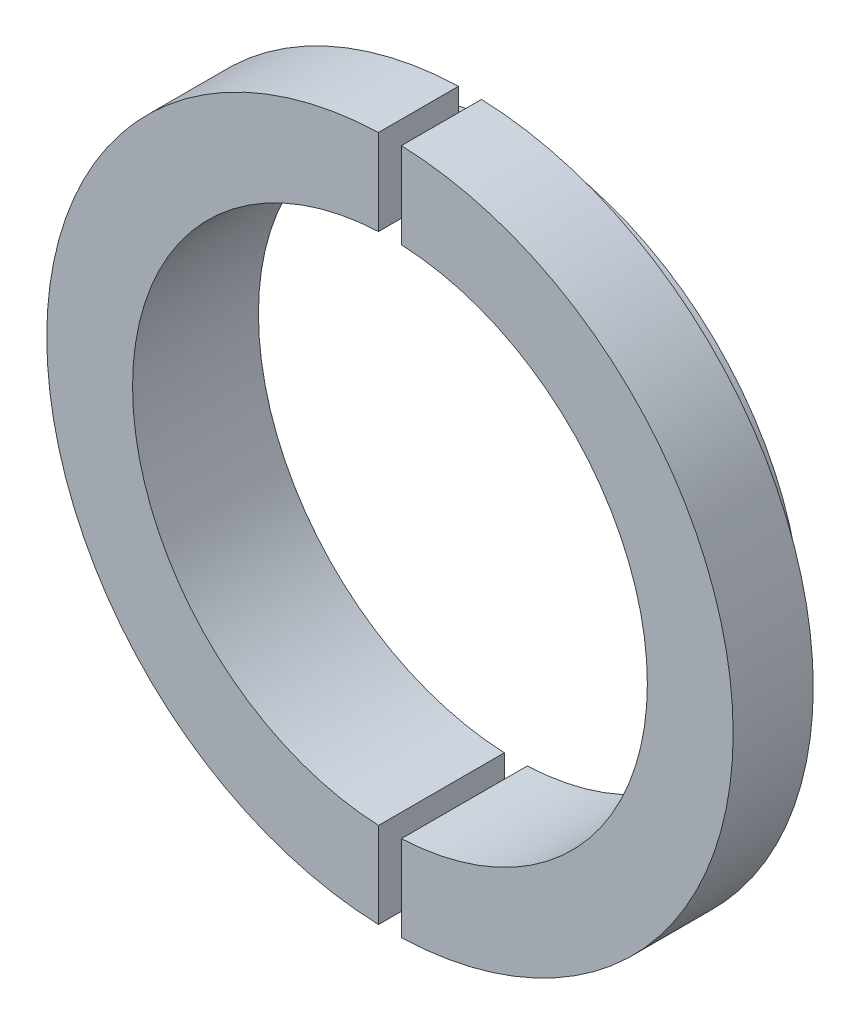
ISO-10303-21;
HEADER;
FILE_DESCRIPTION(('STEP AP214'),'2;1');
FILE_NAME('part.step','',(''),(''),'','','');
FILE_SCHEMA(('AUTOMOTIVE_DESIGN { 1 0 10303 214 1 1 1 1 }'));
ENDSEC;
DATA;
#1=APPLICATION_CONTEXT('core data for automotive mechanical design processes');
#2=APPLICATION_PROTOCOL_DEFINITION('international standard','automotive_design',2000,#1);
#3=PRODUCT_CONTEXT('',#1,'mechanical');
#4=PRODUCT('Part','Part','',(#3));
#5=PRODUCT_RELATED_PRODUCT_CATEGORY('part','',(#4));
#6=PRODUCT_DEFINITION_FORMATION('','',#4);
#7=PRODUCT_DEFINITION_CONTEXT('part definition',#1,'design');
#8=PRODUCT_DEFINITION('design','',#6,#7);
#9=PRODUCT_DEFINITION_SHAPE('','',#8);
#10=(LENGTH_UNIT() NAMED_UNIT(*) SI_UNIT(.MILLI.,.METRE.));
#11=(NAMED_UNIT(*) PLANE_ANGLE_UNIT() SI_UNIT($,.RADIAN.));
#12=(NAMED_UNIT(*) SI_UNIT($,.STERADIAN.) SOLID_ANGLE_UNIT());
#13=UNCERTAINTY_MEASURE_WITH_UNIT(LENGTH_MEASURE(1.E-05),#10,'distance_accuracy_value','');
#14=(GEOMETRIC_REPRESENTATION_CONTEXT(3) GLOBAL_UNCERTAINTY_ASSIGNED_CONTEXT((#13)) GLOBAL_UNIT_ASSIGNED_CONTEXT((#10,
#11,#12)) REPRESENTATION_CONTEXT('',''));
#15=CARTESIAN_POINT('',(0.,0.,0.));
#16=DIRECTION('',(0.,0.,1.));
#17=DIRECTION('',(1.,0.,0.));
#18=AXIS2_PLACEMENT_3D('',#15,#16,#17);
#19=CARTESIAN_POINT('',(0.,0.,0.));
#20=DIRECTION('',(0.,0.,1.));
#21=DIRECTION('',(1.,0.,0.));
#22=AXIS2_PLACEMENT_3D('',#19,#20,#21);
#23=PLANE('',#22);
#24=CARTESIAN_POINT('',(0.,0.,0.));
#25=DIRECTION('',(0.,0.,-1.));
#26=DIRECTION('',(-1.,0.,0.));
#27=AXIS2_PLACEMENT_3D('',#24,#25,#26);
#28=CIRCLE('',#27,25.);
#29=CARTESIAN_POINT('',(-0.999999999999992,-24.9799919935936,0.));
#30=VERTEX_POINT('',#29);
#31=CARTESIAN_POINT('',(-0.999999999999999,24.9799919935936,0.));
#32=VERTEX_POINT('',#31);
#33=EDGE_CURVE('E463',#30,#32,#28,.T.);
#34=ORIENTED_EDGE('',*,*,#33,.T.);
#35=DIRECTION('',(0.,-1.,0.));
#36=VECTOR('',#35,1.);
#37=CARTESIAN_POINT('',(-1.,30.,0.));
#38=LINE('',#37,#36);
#39=CARTESIAN_POINT('',(-0.999999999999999,22.477766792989,0.));
#40=VERTEX_POINT('',#39);
#41=EDGE_CURVE('E502',#32,#40,#38,.T.);
#42=ORIENTED_EDGE('',*,*,#41,.T.);
#43=CARTESIAN_POINT('',(0.,0.,0.));
#44=DIRECTION('',(0.,0.,1.));
#45=DIRECTION('',(1.,0.,0.));
#46=AXIS2_PLACEMENT_3D('',#43,#44,#45);
#47=CIRCLE('',#46,22.5);
#48=CARTESIAN_POINT('',(-0.999999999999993,-22.477766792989,0.));
#49=VERTEX_POINT('',#48);
#50=EDGE_CURVE('E540',#40,#49,#47,.T.);
#51=ORIENTED_EDGE('',*,*,#50,.T.);
#52=EDGE_CURVE('E493',#49,#30,#38,.T.);
#53=ORIENTED_EDGE('',*,*,#52,.T.);
#54=EDGE_LOOP('',(#34,#42,#51,#53));
#55=FACE_BOUND('',#54,.T.);
#56=ADVANCED_FACE('F460',(#55),#23,.F.);
#57=CARTESIAN_POINT('',(0.,0.,11.));
#58=DIRECTION('',(0.,0.,-1.));
#59=DIRECTION('',(-1.,0.,0.));
#60=AXIS2_PLACEMENT_3D('',#57,#58,#59);
#61=CYLINDRICAL_SURFACE('',#60,30.);
#62=CARTESIAN_POINT('',(0.,0.,11.));
#63=DIRECTION('',(0.,0.,1.));
#64=DIRECTION('',(1.,0.,0.));
#65=AXIS2_PLACEMENT_3D('',#62,#63,#64);
#66=CIRCLE('',#65,30.);
#67=CARTESIAN_POINT('',(-1.,29.9833287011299,11.));
#68=VERTEX_POINT('',#67);
#69=CARTESIAN_POINT('',(-0.999999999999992,-29.9833287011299,11.));
#70=VERTEX_POINT('',#69);
#71=EDGE_CURVE('E530',#68,#70,#66,.T.);
#72=ORIENTED_EDGE('',*,*,#71,.F.);
#73=DIRECTION('',(0.,0.,-1.));
#74=VECTOR('',#73,1.);
#75=CARTESIAN_POINT('',(-1.,29.9833287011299,11.));
#76=LINE('',#75,#74);
#77=CARTESIAN_POINT('',(-1.,29.9833287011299,4.));
#78=VERTEX_POINT('',#77);
#79=EDGE_CURVE('E563',#68,#78,#76,.T.);
#80=ORIENTED_EDGE('',*,*,#79,.T.);
#81=CARTESIAN_POINT('',(0.,0.,4.));
#82=DIRECTION('',(0.,0.,-1.));
#83=DIRECTION('',(-1.,0.,0.));
#84=AXIS2_PLACEMENT_3D('',#81,#82,#83);
#85=CIRCLE('',#84,30.);
#86=CARTESIAN_POINT('',(-0.999999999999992,-29.9833287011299,4.));
#87=VERTEX_POINT('',#86);
#88=EDGE_CURVE('E533',#87,#78,#85,.T.);
#89=ORIENTED_EDGE('',*,*,#88,.F.);
#90=DIRECTION('',(0.,0.,-1.));
#91=VECTOR('',#90,1.);
#92=CARTESIAN_POINT('',(-0.999999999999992,-29.9833287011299,11.));
#93=LINE('',#92,#91);
#94=EDGE_CURVE('E537',#87,#70,#93,.F.);
#95=ORIENTED_EDGE('',*,*,#94,.T.);
#96=EDGE_LOOP('',(#72,#80,#89,#95));
#97=FACE_BOUND('',#96,.T.);
#98=ADVANCED_FACE('F565',(#97),#61,.T.);
#99=CARTESIAN_POINT('',(0.,0.,11.));
#100=DIRECTION('',(0.,0.,1.));
#101=DIRECTION('',(1.,0.,0.));
#102=AXIS2_PLACEMENT_3D('',#99,#100,#101);
#103=PLANE('',#102);
#104=DIRECTION('',(0.,-1.,0.));
#105=VECTOR('',#104,1.);
#106=CARTESIAN_POINT('',(-1.,30.,11.));
#107=LINE('',#106,#105);
#108=CARTESIAN_POINT('',(-0.999999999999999,22.477766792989,11.));
#109=VERTEX_POINT('',#108);
#110=EDGE_CURVE('E12',#68,#109,#107,.T.);
#111=ORIENTED_EDGE('',*,*,#110,.F.);
#112=ORIENTED_EDGE('',*,*,#71,.T.);
#113=CARTESIAN_POINT('',(-0.999999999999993,-22.477766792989,11.));
#114=VERTEX_POINT('',#113);
#115=EDGE_CURVE('E471',#114,#70,#107,.T.);
#116=ORIENTED_EDGE('',*,*,#115,.F.);
#117=CARTESIAN_POINT('',(0.,0.,11.));
#118=DIRECTION('',(0.,0.,1.));
#119=DIRECTION('',(1.,0.,0.));
#120=AXIS2_PLACEMENT_3D('',#117,#118,#119);
#121=CIRCLE('',#120,22.5);
#122=EDGE_CURVE('E528',#109,#114,#121,.T.);
#123=ORIENTED_EDGE('',*,*,#122,.F.);
#124=EDGE_LOOP('',(#111,#112,#116,#123));
#125=FACE_BOUND('',#124,.T.);
#126=ADVANCED_FACE('F527',(#125),#103,.T.);
#127=CARTESIAN_POINT('',(0.,0.,11.));
#128=DIRECTION('',(0.,0.,-1.));
#129=DIRECTION('',(-1.,0.,0.));
#130=AXIS2_PLACEMENT_3D('',#127,#128,#129);
#131=CYLINDRICAL_SURFACE('',#130,22.5);
#132=DIRECTION('',(0.,0.,-1.));
#133=VECTOR('',#132,1.);
#134=CARTESIAN_POINT('',(-0.999999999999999,22.477766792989,11.));
#135=LINE('',#134,#133);
#136=EDGE_CURVE('E497',#109,#40,#135,.T.);
#137=ORIENTED_EDGE('',*,*,#136,.F.);
#138=ORIENTED_EDGE('',*,*,#122,.T.);
#139=DIRECTION('',(0.,0.,-1.));
#140=VECTOR('',#139,1.);
#141=CARTESIAN_POINT('',(-0.999999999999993,-22.477766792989,11.));
#142=LINE('',#141,#140);
#143=EDGE_CURVE('E516',#49,#114,#142,.F.);
#144=ORIENTED_EDGE('',*,*,#143,.F.);
#145=ORIENTED_EDGE('',*,*,#50,.F.);
#146=EDGE_LOOP('',(#137,#138,#144,#145));
#147=FACE_BOUND('',#146,.T.);
#148=ADVANCED_FACE('F532',(#147),#131,.F.);
#149=CARTESIAN_POINT('',(0.,0.,4.));
#150=DIRECTION('',(0.,0.,-1.));
#151=DIRECTION('',(-1.,0.,0.));
#152=AXIS2_PLACEMENT_3D('',#149,#150,#151);
#153=PLANE('',#152);
#154=DIRECTION('',(0.,1.,0.));
#155=VECTOR('',#154,1.);
#156=CARTESIAN_POINT('',(-0.999999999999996,0.,4.));
#157=LINE('',#156,#155);
#158=CARTESIAN_POINT('',(-0.999999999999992,-24.9799919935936,4.));
#159=VERTEX_POINT('',#158);
#160=EDGE_CURVE('E531',#87,#159,#157,.T.);
#161=ORIENTED_EDGE('',*,*,#160,.F.);
#162=ORIENTED_EDGE('',*,*,#88,.T.);
#163=CARTESIAN_POINT('',(-0.999999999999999,24.9799919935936,4.));
#164=VERTEX_POINT('',#163);
#165=EDGE_CURVE('E469',#164,#78,#157,.T.);
#166=ORIENTED_EDGE('',*,*,#165,.F.);
#167=CARTESIAN_POINT('',(0.,0.,4.));
#168=DIRECTION('',(0.,0.,-1.));
#169=DIRECTION('',(-1.,0.,0.));
#170=AXIS2_PLACEMENT_3D('',#167,#168,#169);
#171=CIRCLE('',#170,25.);
#172=EDGE_CURVE('E522',#159,#164,#171,.T.);
#173=ORIENTED_EDGE('',*,*,#172,.F.);
#174=EDGE_LOOP('',(#161,#162,#166,#173));
#175=FACE_BOUND('',#174,.T.);
#176=ADVANCED_FACE('F553',(#175),#153,.T.);
#177=CARTESIAN_POINT('',(0.,0.,4.));
#178=DIRECTION('',(0.,0.,-1.));
#179=DIRECTION('',(-1.,0.,0.));
#180=AXIS2_PLACEMENT_3D('',#177,#178,#179);
#181=CYLINDRICAL_SURFACE('',#180,25.);
#182=DIRECTION('',(0.,0.,-1.));
#183=VECTOR('',#182,1.);
#184=CARTESIAN_POINT('',(-0.999999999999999,24.9799919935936,4.));
#185=LINE('',#184,#183);
#186=EDGE_CURVE('E547',#32,#164,#185,.F.);
#187=ORIENTED_EDGE('',*,*,#186,.F.);
#188=ORIENTED_EDGE('',*,*,#33,.F.);
#189=DIRECTION('',(0.,0.,-1.));
#190=VECTOR('',#189,1.);
#191=CARTESIAN_POINT('',(-0.999999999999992,-24.9799919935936,4.));
#192=LINE('',#191,#190);
#193=EDGE_CURVE('E549',#159,#30,#192,.T.);
#194=ORIENTED_EDGE('',*,*,#193,.F.);
#195=ORIENTED_EDGE('',*,*,#172,.T.);
#196=EDGE_LOOP('',(#187,#188,#194,#195));
#197=FACE_BOUND('',#196,.T.);
#198=ADVANCED_FACE('F545',(#197),#181,.T.);
#199=CARTESIAN_POINT('',(-1.,30.,0.));
#200=DIRECTION('',(-1.,0.,0.));
#201=DIRECTION('',(0.,-1.,0.));
#202=AXIS2_PLACEMENT_3D('',#199,#200,#201);
#203=PLANE('',#202);
#204=ORIENTED_EDGE('',*,*,#143,.T.);
#205=ORIENTED_EDGE('',*,*,#115,.T.);
#206=ORIENTED_EDGE('',*,*,#94,.F.);
#207=ORIENTED_EDGE('',*,*,#160,.T.);
#208=ORIENTED_EDGE('',*,*,#193,.T.);
#209=ORIENTED_EDGE('',*,*,#52,.F.);
#210=EDGE_LOOP('',(#204,#205,#206,#207,#208,#209));
#211=FACE_BOUND('',#210,.T.);
#212=ADVANCED_FACE('F517',(#211),#203,.F.);
#213=ORIENTED_EDGE('',*,*,#136,.T.);
#214=ORIENTED_EDGE('',*,*,#41,.F.);
#215=ORIENTED_EDGE('',*,*,#186,.T.);
#216=ORIENTED_EDGE('',*,*,#165,.T.);
#217=ORIENTED_EDGE('',*,*,#79,.F.);
#218=ORIENTED_EDGE('',*,*,#110,.T.);
#219=EDGE_LOOP('',(#213,#214,#215,#216,#217,#218));
#220=FACE_BOUND('',#219,.T.);
#221=ADVANCED_FACE('F566',(#220),#203,.F.);
#222=CLOSED_SHELL('',(#56,#98,#126,#148,#176,#198,#212,#221));
#223=MANIFOLD_SOLID_BREP('B2',#222);
#224=CARTESIAN_POINT('',(0.,0.,4.));
#225=DIRECTION('',(0.,0.,-1.));
#226=DIRECTION('',(-1.,0.,0.));
#227=AXIS2_PLACEMENT_3D('',#224,#225,#226);
#228=CYLINDRICAL_SURFACE('',#227,25.);
#229=DIRECTION('',(0.,0.,-1.));
#230=VECTOR('',#229,1.);
#231=CARTESIAN_POINT('',(1.00000000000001,-24.9799919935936,4.));
#232=LINE('',#231,#230);
#233=CARTESIAN_POINT('',(1.00000000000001,-24.9799919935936,0.));
#234=VERTEX_POINT('',#233);
#235=CARTESIAN_POINT('',(1.00000000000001,-24.9799919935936,4.));
#236=VERTEX_POINT('',#235);
#237=EDGE_CURVE('E458',#234,#236,#232,.F.);
#238=ORIENTED_EDGE('',*,*,#237,.F.);
#239=CARTESIAN_POINT('',(0.,0.,0.));
#240=DIRECTION('',(0.,0.,-1.));
#241=DIRECTION('',(-1.,0.,0.));
#242=AXIS2_PLACEMENT_3D('',#239,#240,#241);
#243=CIRCLE('',#242,25.);
#244=CARTESIAN_POINT('',(1.,24.9799919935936,0.));
#245=VERTEX_POINT('',#244);
#246=EDGE_CURVE('E673',#245,#234,#243,.T.);
#247=ORIENTED_EDGE('',*,*,#246,.F.);
#248=DIRECTION('',(0.,0.,-1.));
#249=VECTOR('',#248,1.);
#250=CARTESIAN_POINT('',(1.,24.9799919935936,4.));
#251=LINE('',#250,#249);
#252=CARTESIAN_POINT('',(1.,24.9799919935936,4.));
#253=VERTEX_POINT('',#252);
#254=EDGE_CURVE('E623',#253,#245,#251,.T.);
#255=ORIENTED_EDGE('',*,*,#254,.F.);
#256=CARTESIAN_POINT('',(0.,0.,4.));
#257=DIRECTION('',(0.,0.,-1.));
#258=DIRECTION('',(-1.,0.,0.));
#259=AXIS2_PLACEMENT_3D('',#256,#257,#258);
#260=CIRCLE('',#259,25.);
#261=EDGE_CURVE('E693',#253,#236,#260,.T.);
#262=ORIENTED_EDGE('',*,*,#261,.T.);
#263=EDGE_LOOP('',(#238,#247,#255,#262));
#264=FACE_BOUND('',#263,.T.);
#265=ADVANCED_FACE('F615',(#264),#228,.T.);
#266=CARTESIAN_POINT('',(0.,0.,4.));
#267=DIRECTION('',(0.,0.,-1.));
#268=DIRECTION('',(-1.,0.,0.));
#269=AXIS2_PLACEMENT_3D('',#266,#267,#268);
#270=PLANE('',#269);
#271=DIRECTION('',(0.,-1.,0.));
#272=VECTOR('',#271,1.);
#273=CARTESIAN_POINT('',(1.,0.,4.));
#274=LINE('',#273,#272);
#275=CARTESIAN_POINT('',(1.,29.9833287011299,4.));
#276=VERTEX_POINT('',#275);
#277=EDGE_CURVE('E637',#276,#253,#274,.T.);
#278=ORIENTED_EDGE('',*,*,#277,.F.);
#279=CARTESIAN_POINT('',(0.,0.,4.));
#280=DIRECTION('',(0.,0.,-1.));
#281=DIRECTION('',(-1.,0.,0.));
#282=AXIS2_PLACEMENT_3D('',#279,#280,#281);
#283=CIRCLE('',#282,30.);
#284=CARTESIAN_POINT('',(1.00000000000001,-29.9833287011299,4.));
#285=VERTEX_POINT('',#284);
#286=EDGE_CURVE('E688',#276,#285,#283,.T.);
#287=ORIENTED_EDGE('',*,*,#286,.T.);
#288=EDGE_CURVE('E708',#236,#285,#274,.T.);
#289=ORIENTED_EDGE('',*,*,#288,.F.);
#290=ORIENTED_EDGE('',*,*,#261,.F.);
#291=EDGE_LOOP('',(#278,#287,#289,#290));
#292=FACE_BOUND('',#291,.T.);
#293=ADVANCED_FACE('F725',(#292),#270,.T.);
#294=CARTESIAN_POINT('',(0.,0.,11.));
#295=DIRECTION('',(0.,0.,-1.));
#296=DIRECTION('',(-1.,0.,0.));
#297=AXIS2_PLACEMENT_3D('',#294,#295,#296);
#298=CYLINDRICAL_SURFACE('',#297,22.5);
#299=DIRECTION('',(0.,0.,-1.));
#300=VECTOR('',#299,1.);
#301=CARTESIAN_POINT('',(1.00000000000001,-22.477766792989,11.));
#302=LINE('',#301,#300);
#303=CARTESIAN_POINT('',(1.00000000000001,-22.477766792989,11.));
#304=VERTEX_POINT('',#303);
#305=CARTESIAN_POINT('',(1.00000000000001,-22.477766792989,0.));
#306=VERTEX_POINT('',#305);
#307=EDGE_CURVE('E665',#304,#306,#302,.T.);
#308=ORIENTED_EDGE('',*,*,#307,.F.);
#309=CARTESIAN_POINT('',(0.,0.,11.));
#310=DIRECTION('',(0.,0.,1.));
#311=DIRECTION('',(1.,0.,0.));
#312=AXIS2_PLACEMENT_3D('',#309,#310,#311);
#313=CIRCLE('',#312,22.5);
#314=CARTESIAN_POINT('',(1.,22.477766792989,11.));
#315=VERTEX_POINT('',#314);
#316=EDGE_CURVE('E687',#304,#315,#313,.T.);
#317=ORIENTED_EDGE('',*,*,#316,.T.);
#318=DIRECTION('',(0.,0.,-1.));
#319=VECTOR('',#318,1.);
#320=CARTESIAN_POINT('',(1.,22.477766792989,11.));
#321=LINE('',#320,#319);
#322=CARTESIAN_POINT('',(1.,22.477766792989,0.));
#323=VERTEX_POINT('',#322);
#324=EDGE_CURVE('E674',#323,#315,#321,.F.);
#325=ORIENTED_EDGE('',*,*,#324,.F.);
#326=CARTESIAN_POINT('',(0.,0.,0.));
#327=DIRECTION('',(0.,0.,1.));
#328=DIRECTION('',(1.,0.,0.));
#329=AXIS2_PLACEMENT_3D('',#326,#327,#328);
#330=CIRCLE('',#329,22.5);
#331=EDGE_CURVE('E681',#306,#323,#330,.T.);
#332=ORIENTED_EDGE('',*,*,#331,.F.);
#333=EDGE_LOOP('',(#308,#317,#325,#332));
#334=FACE_BOUND('',#333,.T.);
#335=ADVANCED_FACE('F686',(#334),#298,.F.);
#336=CARTESIAN_POINT('',(0.,0.,11.));
#337=DIRECTION('',(0.,0.,1.));
#338=DIRECTION('',(1.,0.,0.));
#339=AXIS2_PLACEMENT_3D('',#336,#337,#338);
#340=PLANE('',#339);
#341=DIRECTION('',(0.,1.,0.));
#342=VECTOR('',#341,1.);
#343=CARTESIAN_POINT('',(1.,30.,11.));
#344=LINE('',#343,#342);
#345=CARTESIAN_POINT('',(1.00000000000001,-29.9833287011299,11.));
#346=VERTEX_POINT('',#345);
#347=EDGE_CURVE('E668',#346,#304,#344,.T.);
#348=ORIENTED_EDGE('',*,*,#347,.F.);
#349=CARTESIAN_POINT('',(0.,0.,11.));
#350=DIRECTION('',(0.,0.,1.));
#351=DIRECTION('',(1.,0.,0.));
#352=AXIS2_PLACEMENT_3D('',#349,#350,#351);
#353=CIRCLE('',#352,30.);
#354=CARTESIAN_POINT('',(1.,29.9833287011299,11.));
#355=VERTEX_POINT('',#354);
#356=EDGE_CURVE('E690',#346,#355,#353,.T.);
#357=ORIENTED_EDGE('',*,*,#356,.T.);
#358=EDGE_CURVE('E713',#315,#355,#344,.T.);
#359=ORIENTED_EDGE('',*,*,#358,.F.);
#360=ORIENTED_EDGE('',*,*,#316,.F.);
#361=EDGE_LOOP('',(#348,#357,#359,#360));
#362=FACE_BOUND('',#361,.T.);
#363=ADVANCED_FACE('F719',(#362),#340,.T.);
#364=CARTESIAN_POINT('',(0.,0.,11.));
#365=DIRECTION('',(0.,0.,-1.));
#366=DIRECTION('',(-1.,0.,0.));
#367=AXIS2_PLACEMENT_3D('',#364,#365,#366);
#368=CYLINDRICAL_SURFACE('',#367,30.);
#369=ORIENTED_EDGE('',*,*,#356,.F.);
#370=DIRECTION('',(0.,0.,-1.));
#371=VECTOR('',#370,1.);
#372=CARTESIAN_POINT('',(1.00000000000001,-29.9833287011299,11.));
#373=LINE('',#372,#371);
#374=EDGE_CURVE('E705',#346,#285,#373,.T.);
#375=ORIENTED_EDGE('',*,*,#374,.T.);
#376=ORIENTED_EDGE('',*,*,#286,.F.);
#377=DIRECTION('',(0.,0.,-1.));
#378=VECTOR('',#377,1.);
#379=CARTESIAN_POINT('',(1.,29.9833287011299,11.));
#380=LINE('',#379,#378);
#381=EDGE_CURVE('E709',#276,#355,#380,.F.);
#382=ORIENTED_EDGE('',*,*,#381,.T.);
#383=EDGE_LOOP('',(#369,#375,#376,#382));
#384=FACE_BOUND('',#383,.T.);
#385=ADVANCED_FACE('F617',(#384),#368,.T.);
#386=CARTESIAN_POINT('',(0.,0.,0.));
#387=DIRECTION('',(0.,0.,1.));
#388=DIRECTION('',(1.,0.,0.));
#389=AXIS2_PLACEMENT_3D('',#386,#387,#388);
#390=PLANE('',#389);
#391=ORIENTED_EDGE('',*,*,#246,.T.);
#392=DIRECTION('',(0.,1.,0.));
#393=VECTOR('',#392,1.);
#394=CARTESIAN_POINT('',(1.,30.,0.));
#395=LINE('',#394,#393);
#396=EDGE_CURVE('E629',#234,#306,#395,.T.);
#397=ORIENTED_EDGE('',*,*,#396,.T.);
#398=ORIENTED_EDGE('',*,*,#331,.T.);
#399=EDGE_CURVE('E683',#323,#245,#395,.T.);
#400=ORIENTED_EDGE('',*,*,#399,.T.);
#401=EDGE_LOOP('',(#391,#397,#398,#400));
#402=FACE_BOUND('',#401,.T.);
#403=ADVANCED_FACE('F679',(#402),#390,.F.);
#404=CARTESIAN_POINT('',(1.,30.,0.));
#405=DIRECTION('',(1.,0.,0.));
#406=DIRECTION('',(0.,1.,0.));
#407=AXIS2_PLACEMENT_3D('',#404,#405,#406);
#408=PLANE('',#407);
#409=ORIENTED_EDGE('',*,*,#324,.T.);
#410=ORIENTED_EDGE('',*,*,#358,.T.);
#411=ORIENTED_EDGE('',*,*,#381,.F.);
#412=ORIENTED_EDGE('',*,*,#277,.T.);
#413=ORIENTED_EDGE('',*,*,#254,.T.);
#414=ORIENTED_EDGE('',*,*,#399,.F.);
#415=EDGE_LOOP('',(#409,#410,#411,#412,#413,#414));
#416=FACE_BOUND('',#415,.T.);
#417=ADVANCED_FACE('F698',(#416),#408,.F.);
#418=ORIENTED_EDGE('',*,*,#307,.T.);
#419=ORIENTED_EDGE('',*,*,#396,.F.);
#420=ORIENTED_EDGE('',*,*,#237,.T.);
#421=ORIENTED_EDGE('',*,*,#288,.T.);
#422=ORIENTED_EDGE('',*,*,#374,.F.);
#423=ORIENTED_EDGE('',*,*,#347,.T.);
#424=EDGE_LOOP('',(#418,#419,#420,#421,#422,#423));
#425=FACE_BOUND('',#424,.T.);
#426=ADVANCED_FACE('F666',(#425),#408,.F.);
#427=CLOSED_SHELL('',(#265,#293,#335,#363,#385,#403,#417,#426));
#428=MANIFOLD_SOLID_BREP('B6',#427);
#429=ADVANCED_BREP_SHAPE_REPRESENTATION('',(#18,#223,#428),#14);
#430=SHAPE_DEFINITION_REPRESENTATION(#9,#429);
ENDSEC;
END-ISO-10303-21;
